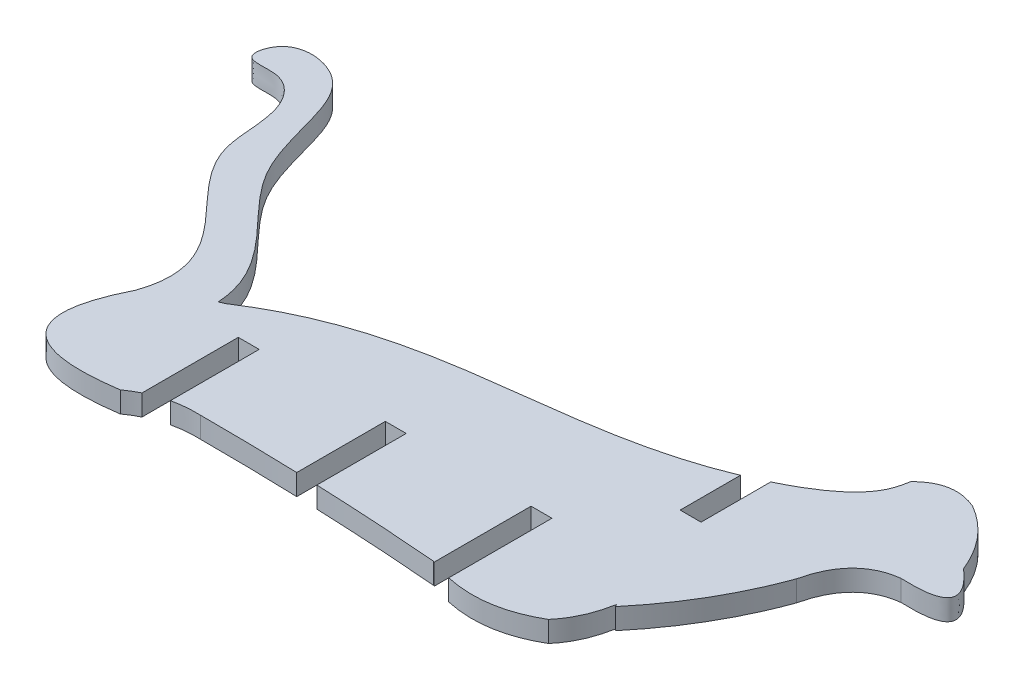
from build123d import *

# Parameters (mm, degrees)
SALIENTE_EXTRUIR1_DEPTH = 3


with BuildPart() as part:
    # Croquis2 → Saliente-Extruir1 (new body)
    with BuildSketch(Plane(origin=(0, 0, 0), x_dir=(1, 0, 0), z_dir=(0, 1, 0))):
        with BuildLine():
            Line((55.05664845, 13.565418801), (55.240587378, 13.23202084))
            add(Edge.make_bspline(
                [(55.240587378, 13.23202084), (61.580578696, 20.799919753), (64.788177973, 29.701552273)],
                knots=[0, 0, 0, 0.729810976, 0.729810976, 0.729810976], degree=2))
            add(Edge.make_bspline(
                [(64.788177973, 29.701552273), (66.345854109, 36.510249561), (72.231377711, 37.247875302)],
                knots=[0, 0, 0, 1, 1, 1], degree=2))
            add(Edge.make_bspline(
                [(72.231377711, 37.247875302), (82.473682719, 36.798598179), (75.526750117, 42.926750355)],
                knots=[0, 0, 0, 1, 1, 1], degree=2))
            add(Edge.make_bspline(
                [(75.526750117, 42.926750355), (73.292636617, 48.501107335), (68.403186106, 51.352545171)],
                knots=[0, 0, 0, 1, 1, 1], degree=2))
            add(Edge.make_bspline(
                [(68.403186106, 51.352545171), (64.086881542, 53.226470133), (60.901206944, 49.955175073)],
                knots=[0, 0, 0, 1, 1, 1], degree=2))
            add(Edge.make_bspline(
                [(60.901206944, 49.955175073), (60.755469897, 49.094987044), (59.818956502, 44.943653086), (54.890749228, 41.821506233), (50.893759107, 39.880415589)],
                knots=[0.191058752, 0.191058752, 0.191058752, 0.191058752, 0.219406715, 0.344529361, 0.344529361, 0.344529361, 0.344529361], degree=3))
            Line((50.893759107, 39.880415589), (50.893759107, 29.880415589))
            Line((50.893759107, 29.880415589), (47.893759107, 29.880415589))
            Line((47.893759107, 29.880415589), (47.893759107, 38.531424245))
            add(Edge.make_bspline(
                [(47.893759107, 38.531424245), (28.008224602, 30.280640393), (8.635550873, 35.49771048), (-10.374158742, 22.936071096)],
                knots=[0.375874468, 0.375874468, 0.375874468, 0.375874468, 1, 1, 1, 1], degree=3))
            add(Edge.make_bspline(
                [(-11.135661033, 22.600586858), (-10.883076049, 22.714918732), (-10.629217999, 22.826726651), (-10.374158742, 22.936071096)],
                knots=[0.550254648, 0.550254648, 0.550254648, 0.550254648, 0.571137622, 0.571137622, 0.571137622, 0.571137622], degree=3))
            add(Edge.make_bspline(
                [(-18.516922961, 18.150768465), (-14.511906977, 29.534340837), (-31.979748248, 35.37078841), (-29.75162207, 50.734394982), (-34.446231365, 55.84020083), (-40.121813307, 54.407976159), (-38.519478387, 60.889337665), (-29.652065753, 59.9510091), (-26.77885344, 51.15616483), (-23.538284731, 37.411897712), (-11.646426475, 31.263472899), (-11.135661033, 22.600586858)],
                knots=[0, 0, 0, 0, 0.276371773, 0.37536682, 0.42621598, 0.467018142, 0.496246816, 0.571537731, 0.655962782, 0.760228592, 1, 1, 1, 1], degree=3))
            add(Edge.make_bspline(
                [(-18.516922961, 18.150768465), (-26.752270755, 1.770845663), (-7.233716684, 4.643674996)],
                knots=[0, 0, 0, 1, 1, 1], degree=2))
            add(Edge.make_bspline(
                [(-5.293400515, 5.822635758), (-5.964431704, 5.487907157), (-6.611203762, 5.094920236), (-7.233716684, 4.643674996)],
                knots=[0.757247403, 0.757247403, 0.757247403, 0.757247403, 1, 1, 1, 1], degree=3))
            Line((-5.293400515, 5.822635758), (-5.293400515, 19.643674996))
            Line((-5.293400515, 19.643674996), (-2.293400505, 19.643674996))
            Line((-2.293400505, 19.643674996), (-2.293400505, 6.894940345))
            add(Edge.make_bspline(
                [(1.694465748, 7.25441614), (-0.404856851, 7.327771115), (-2.293400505, 6.894940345)],
                knots=[0, 0, 0, 0.413122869, 0.413122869, 0.413122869], degree=2))
            add(Edge.make_bspline(
                [(15.706599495, 7.031839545), (11.038092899, 7.184301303), (6.36738165, 7.258493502), (1.694465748, 7.25441614)],
                knots=[0.702434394, 0.702434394, 0.702434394, 0.702434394, 1, 1, 1, 1], degree=3))
            Line((15.706599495, 7.031839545), (15.706599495, 19.749360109))
            Line((15.706599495, 19.749360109), (18.7065995, 19.749360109))
            Line((18.7065995, 19.749360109), (18.7065995, 6.923081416))
            add(Edge.make_bspline(
                [(36.557355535, 5.829267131), (30.610690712, 6.321224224), (24.6604387, 6.685828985), (18.7065995, 6.923081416)],
                knots=[0.259120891, 0.259120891, 0.259120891, 0.259120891, 0.638689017, 0.638689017, 0.638689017, 0.638689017], degree=3))
            add(Edge.make_bspline(
                [(36.557355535, 5.829267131), (36.632013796, 5.799620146), (36.7065995, 5.770599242)],
                knots=[0, 0, 0, 0.009141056, 0.009141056, 0.009141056], degree=2))
            Line((36.7065995, 5.770599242), (36.7065995, 19.667448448))
            Line((36.7065995, 19.667448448), (39.706599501, 19.667448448))
            Line((39.706599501, 19.667448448), (39.706599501, 4.849968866))
            add(Edge.make_bspline(
                [(39.706599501, 4.849968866), (43.999967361, 3.892541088), (48.105683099, 4.554354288), (52.023746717, 6.835408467)],
                knots=[0.194812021, 0.194812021, 0.194812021, 0.194812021, 1, 1, 1, 1], degree=3))
            add(Edge.make_bspline(
                [(55.05664845, 13.565418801), (54.337343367, 9.511159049), (52.023746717, 6.835408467)],
                knots=[0, 0, 0, 0.509778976, 0.509778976, 0.509778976], degree=2))
        make_face()
    extrude(amount=SALIENTE_EXTRUIR1_DEPTH)


solid = part.part
